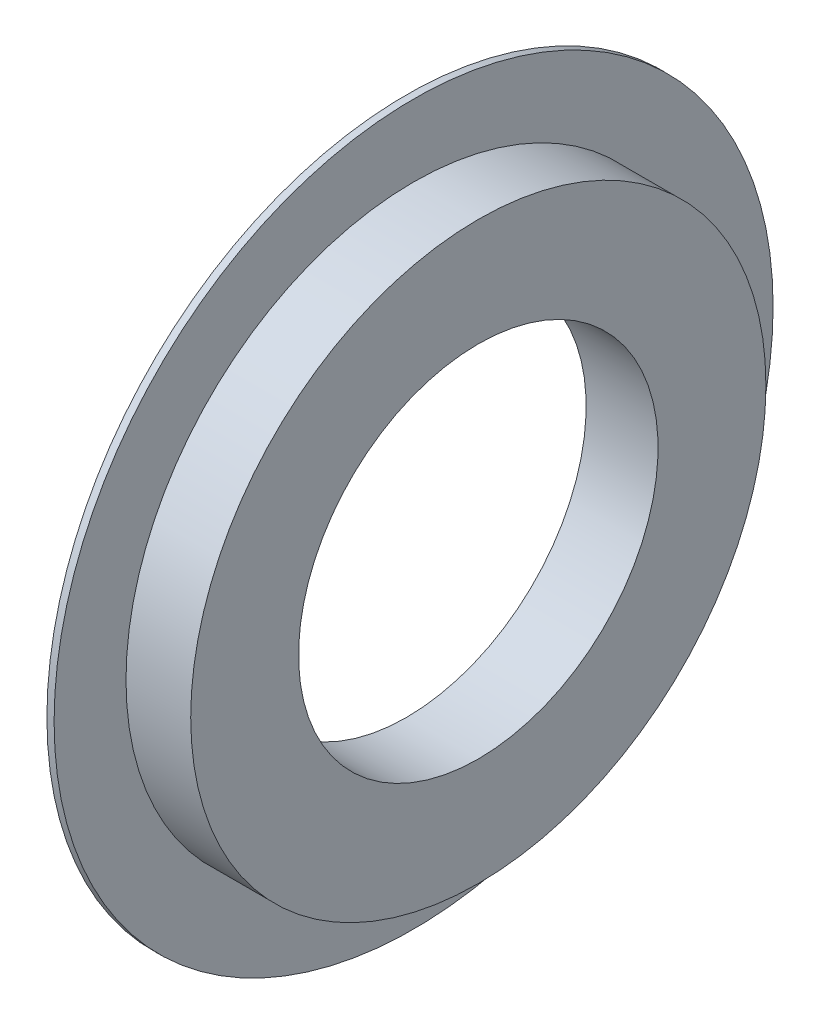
ISO-10303-21;
HEADER;
FILE_DESCRIPTION(('STEP AP214'),'2;1');
FILE_NAME('part.step','',(''),(''),'','','');
FILE_SCHEMA(('AUTOMOTIVE_DESIGN { 1 0 10303 214 1 1 1 1 }'));
ENDSEC;
DATA;
#1=APPLICATION_CONTEXT('core data for automotive mechanical design processes');
#2=APPLICATION_PROTOCOL_DEFINITION('international standard','automotive_design',2000,#1);
#3=PRODUCT_CONTEXT('',#1,'mechanical');
#4=PRODUCT('Part','Part','',(#3));
#5=PRODUCT_RELATED_PRODUCT_CATEGORY('part','',(#4));
#6=PRODUCT_DEFINITION_FORMATION('','',#4);
#7=PRODUCT_DEFINITION_CONTEXT('part definition',#1,'design');
#8=PRODUCT_DEFINITION('design','',#6,#7);
#9=PRODUCT_DEFINITION_SHAPE('','',#8);
#10=(LENGTH_UNIT() NAMED_UNIT(*) SI_UNIT(.MILLI.,.METRE.));
#11=(NAMED_UNIT(*) PLANE_ANGLE_UNIT() SI_UNIT($,.RADIAN.));
#12=(NAMED_UNIT(*) SI_UNIT($,.STERADIAN.) SOLID_ANGLE_UNIT());
#13=UNCERTAINTY_MEASURE_WITH_UNIT(LENGTH_MEASURE(1.E-05),#10,'distance_accuracy_value','');
#14=(GEOMETRIC_REPRESENTATION_CONTEXT(3) GLOBAL_UNCERTAINTY_ASSIGNED_CONTEXT((#13)) GLOBAL_UNIT_ASSIGNED_CONTEXT((#10,
#11,#12)) REPRESENTATION_CONTEXT('',''));
#15=CARTESIAN_POINT('',(0.,0.,0.));
#16=DIRECTION('',(0.,0.,1.));
#17=DIRECTION('',(1.,0.,0.));
#18=AXIS2_PLACEMENT_3D('',#15,#16,#17);
#19=CARTESIAN_POINT('',(-1.27,-0.923636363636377,0.));
#20=DIRECTION('',(1.,0.,0.));
#21=DIRECTION('',(0.,0.,-1.));
#22=AXIS2_PLACEMENT_3D('',#19,#20,#21);
#23=PLANE('',#22);
#24=CARTESIAN_POINT('',(-1.26999999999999,0.,0.));
#25=DIRECTION('',(-1.,0.,0.));
#26=DIRECTION('',(0.,-1.,0.));
#27=AXIS2_PLACEMENT_3D('',#24,#25,#26);
#28=CIRCLE('',#27,6.35);
#29=CARTESIAN_POINT('',(-1.27,-6.35,0.));
#30=VERTEX_POINT('',#29);
#31=EDGE_CURVE('E34',#30,#30,#28,.F.);
#32=ORIENTED_EDGE('',*,*,#31,.T.);
#33=EDGE_LOOP('',(#32));
#34=FACE_BOUND('',#33,.T.);
#35=CARTESIAN_POINT('',(-1.26999999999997,0.,0.));
#36=DIRECTION('',(1.,0.,0.));
#37=DIRECTION('',(0.,0.,-1.));
#38=AXIS2_PLACEMENT_3D('',#35,#36,#37);
#39=CIRCLE('',#38,12.7);
#40=CARTESIAN_POINT('',(-1.26999999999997,0.,-12.7));
#41=VERTEX_POINT('',#40);
#42=EDGE_CURVE('E18',#41,#41,#39,.T.);
#43=ORIENTED_EDGE('',*,*,#42,.F.);
#44=EDGE_LOOP('',(#43));
#45=FACE_BOUND('',#44,.T.);
#46=ADVANCED_FACE('F14',(#34,#45),#23,.F.);
#47=CARTESIAN_POINT('',(-1.26999999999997,0.,0.));
#48=DIRECTION('',(1.,0.,0.));
#49=DIRECTION('',(0.,0.,-1.));
#50=AXIS2_PLACEMENT_3D('',#47,#48,#49);
#51=CYLINDRICAL_SURFACE('',#50,12.7);
#52=ORIENTED_EDGE('',*,*,#42,.T.);
#53=EDGE_LOOP('',(#52));
#54=FACE_BOUND('',#53,.T.);
#55=CARTESIAN_POINT('',(-1.01600000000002,0.,0.));
#56=DIRECTION('',(1.,0.,0.));
#57=DIRECTION('',(0.,0.,-1.));
#58=AXIS2_PLACEMENT_3D('',#55,#56,#57);
#59=CIRCLE('',#58,12.7);
#60=CARTESIAN_POINT('',(-1.01600000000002,0.,-12.7));
#61=VERTEX_POINT('',#60);
#62=EDGE_CURVE('E32',#61,#61,#59,.T.);
#63=ORIENTED_EDGE('',*,*,#62,.F.);
#64=EDGE_LOOP('',(#63));
#65=FACE_BOUND('',#64,.T.);
#66=ADVANCED_FACE('F41',(#54,#65),#51,.T.);
#67=CARTESIAN_POINT('',(1.27,0.,0.));
#68=DIRECTION('',(-1.,0.,0.));
#69=DIRECTION('',(0.,-1.,0.));
#70=AXIS2_PLACEMENT_3D('',#67,#68,#69);
#71=CYLINDRICAL_SURFACE('',#70,6.35);
#72=ORIENTED_EDGE('',*,*,#31,.F.);
#73=EDGE_LOOP('',(#72));
#74=FACE_BOUND('',#73,.T.);
#75=CARTESIAN_POINT('',(1.27,0.,0.));
#76=DIRECTION('',(-1.,0.,0.));
#77=DIRECTION('',(0.,-1.,0.));
#78=AXIS2_PLACEMENT_3D('',#75,#76,#77);
#79=CIRCLE('',#78,6.35);
#80=CARTESIAN_POINT('',(1.26999999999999,-6.35,0.));
#81=VERTEX_POINT('',#80);
#82=EDGE_CURVE('E27',#81,#81,#79,.T.);
#83=ORIENTED_EDGE('',*,*,#82,.F.);
#84=EDGE_LOOP('',(#83));
#85=FACE_BOUND('',#84,.T.);
#86=ADVANCED_FACE('F50',(#74,#85),#71,.F.);
#87=CARTESIAN_POINT('',(-1.01600000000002,1.1545454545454,0.));
#88=DIRECTION('',(1.,0.,0.));
#89=DIRECTION('',(0.,0.,-1.));
#90=AXIS2_PLACEMENT_3D('',#87,#88,#89);
#91=PLANE('',#90);
#92=CARTESIAN_POINT('',(-1.01600000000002,0.,0.));
#93=DIRECTION('',(1.,0.,0.));
#94=DIRECTION('',(0.,1.,0.));
#95=AXIS2_PLACEMENT_3D('',#92,#93,#94);
#96=CIRCLE('',#95,10.16);
#97=CARTESIAN_POINT('',(-1.01600000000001,10.16,0.));
#98=VERTEX_POINT('',#97);
#99=EDGE_CURVE('E22',#98,#98,#96,.T.);
#100=ORIENTED_EDGE('',*,*,#99,.F.);
#101=EDGE_LOOP('',(#100));
#102=FACE_BOUND('',#101,.T.);
#103=ORIENTED_EDGE('',*,*,#62,.T.);
#104=EDGE_LOOP('',(#103));
#105=FACE_BOUND('',#104,.T.);
#106=ADVANCED_FACE('F58',(#102,#105),#91,.T.);
#107=CARTESIAN_POINT('',(1.27,-0.923636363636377,0.));
#108=DIRECTION('',(1.,0.,0.));
#109=DIRECTION('',(0.,0.,-1.));
#110=AXIS2_PLACEMENT_3D('',#107,#108,#109);
#111=PLANE('',#110);
#112=ORIENTED_EDGE('',*,*,#82,.T.);
#113=EDGE_LOOP('',(#112));
#114=FACE_BOUND('',#113,.T.);
#115=CARTESIAN_POINT('',(1.27,0.,0.));
#116=DIRECTION('',(1.,0.,0.));
#117=DIRECTION('',(0.,1.,0.));
#118=AXIS2_PLACEMENT_3D('',#115,#116,#117);
#119=CIRCLE('',#118,10.16);
#120=CARTESIAN_POINT('',(1.27000000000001,10.16,0.));
#121=VERTEX_POINT('',#120);
#122=EDGE_CURVE('E10',#121,#121,#119,.F.);
#123=ORIENTED_EDGE('',*,*,#122,.F.);
#124=EDGE_LOOP('',(#123));
#125=FACE_BOUND('',#124,.T.);
#126=ADVANCED_FACE('F53',(#114,#125),#111,.T.);
#127=CARTESIAN_POINT('',(-1.01600000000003,0.,0.));
#128=DIRECTION('',(1.,0.,0.));
#129=DIRECTION('',(0.,1.,0.));
#130=AXIS2_PLACEMENT_3D('',#127,#128,#129);
#131=CYLINDRICAL_SURFACE('',#130,10.16);
#132=ORIENTED_EDGE('',*,*,#99,.T.);
#133=EDGE_LOOP('',(#132));
#134=FACE_BOUND('',#133,.T.);
#135=ORIENTED_EDGE('',*,*,#122,.T.);
#136=EDGE_LOOP('',(#135));
#137=FACE_BOUND('',#136,.T.);
#138=ADVANCED_FACE('F16',(#134,#137),#131,.T.);
#139=CLOSED_SHELL('',(#46,#66,#86,#106,#126,#138));
#140=MANIFOLD_SOLID_BREP('B1',#139);
#141=ADVANCED_BREP_SHAPE_REPRESENTATION('',(#18,#140),#14);
#142=SHAPE_DEFINITION_REPRESENTATION(#9,#141);
ENDSEC;
END-ISO-10303-21;
